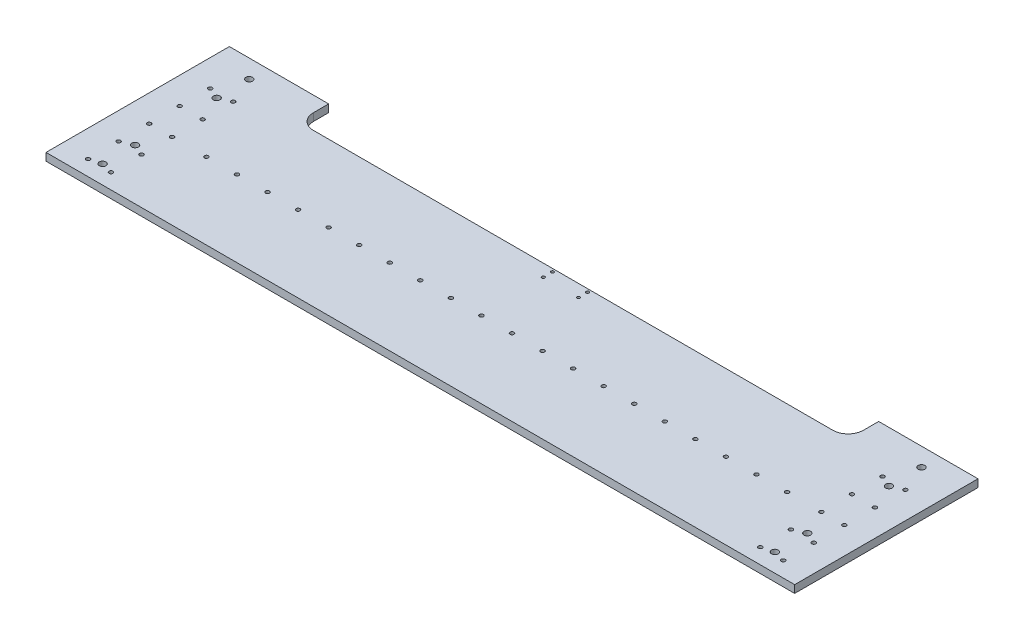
from build123d import *

# Parameters (mm, degrees)
SKETCH1_W                                        = 1244.6
SKETCH1_H                                        = 304.8
BOSS_EXTRUDE1_DEPTH                              = 12.7
CUT_EXTRUDE1_DEPTH                               = 641.815371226
CBORE_FOR_1_4_SOCKET_HEAD_CAP_SCREW1_D           = 6.5278
CBORE_FOR_1_4_SOCKET_HEAD_CAP_SCREW1_CBORE_D     = 11.1125
CBORE_FOR_1_4_SOCKET_HEAD_CAP_SCREW1_CBORE_DEPTH = 6.35
LPATTERN1_COUNT                                  = 2
LPATTERN1_PITCH                                  = 38.1
LPATTERN1_COUNT_DIR2                             = 5
LPATTERN1_PITCH_DIR2                             = 50.8
MIRROR1_COPY_1_D                                 = 6.5278
MIRROR1_COPY_1_CBORE_D                           = 11.1125
MIRROR1_COPY_1_CBORE_DEPTH                       = 6.35
MIRROR1_COPY_2_D                                 = 6.5278
MIRROR1_COPY_2_CBORE_D                           = 11.1125
MIRROR1_COPY_2_CBORE_DEPTH                       = 6.35
MIRROR1_COPY_3_D                                 = 6.5278
MIRROR1_COPY_3_CBORE_D                           = 11.1125
MIRROR1_COPY_3_CBORE_DEPTH                       = 6.35
MIRROR1_COPY_4_D                                 = 6.5278
MIRROR1_COPY_4_CBORE_D                           = 11.1125
MIRROR1_COPY_4_CBORE_DEPTH                       = 6.35
MIRROR1_COPY_5_D                                 = 6.5278
MIRROR1_COPY_5_CBORE_D                           = 11.1125
MIRROR1_COPY_5_CBORE_DEPTH                       = 6.35
MIRROR1_COPY_6_D                                 = 6.5278
MIRROR1_COPY_6_CBORE_D                           = 11.1125
MIRROR1_COPY_6_CBORE_DEPTH                       = 6.35
MIRROR1_COPY_7_D                                 = 6.5278
MIRROR1_COPY_7_CBORE_D                           = 11.1125
MIRROR1_COPY_7_CBORE_DEPTH                       = 6.35
MIRROR1_COPY_8_D                                 = 6.5278
MIRROR1_COPY_8_CBORE_D                           = 11.1125
MIRROR1_COPY_8_CBORE_DEPTH                       = 6.35
MIRROR1_COPY_9_D                                 = 6.5278
MIRROR1_COPY_9_CBORE_D                           = 11.1125
MIRROR1_COPY_9_CBORE_DEPTH                       = 6.35
CBORE_FOR_1_4_SOCKET_HEAD_CAP_SCREW2_D           = 6.5278
CBORE_FOR_1_4_SOCKET_HEAD_CAP_SCREW2_CBORE_D     = 11.1125
CBORE_FOR_1_4_SOCKET_HEAD_CAP_SCREW2_CBORE_DEPTH = 6.35
LPATTERN2_COUNT                                  = 20
LPATTERN2_PITCH                                  = 50.8
CBORE_FOR_10_SOCKET_HEAD_CAP_SCREW1_D            = 4.9784
CBORE_FOR_10_SOCKET_HEAD_CAP_SCREW1_CBORE_D      = 9.525
CBORE_FOR_10_SOCKET_HEAD_CAP_SCREW1_CBORE_DEPTH  = 4.826
F_7_16_0_4375_DIAMETER_HOLE1_D                   = 11.1125


with BuildPart() as part:
    # Sketch1 → Boss-Extrude1 (new body)
    with BuildSketch(Plane(origin=(0, 0, 0), x_dir=(1, 0, 0), z_dir=(0, 1, 0))):
        Rectangle(SKETCH1_W, SKETCH1_H)
    extrude(amount=BOSS_EXTRUDE1_DEPTH)

    # Sketch2 → Cut-Extrude1 (cut, through all)
    with BuildSketch(Plane(origin=(0, 12.7, 0), x_dir=(1, 0, 0), z_dir=(0, 1, 0))):
        with BuildLine():
            Line((-457.2, 152.4), (457.2, 152.4))
            Line((457.2, 152.4), (457.2, 127))
            ThreePointArc((457.2, 127), (449.760512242, 109.039487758), (431.8, 101.6))
            Line((431.8, 101.6), (-431.8, 101.6))
            ThreePointArc((-431.8, 101.6), (-449.760512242, 109.039487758), (-457.2, 127))
            Line((-457.2, 127), (-457.2, 152.4))
        make_face()
    extrude(amount=-CUT_EXTRUDE1_DEPTH, mode=Mode.SUBTRACT)

    # CBORE for 1_4 Socket Head Cap Screw1 (through all)
    with Locations(Plane(origin=(0, 0, 0), x_dir=(-1, 0, 0), z_dir=(0, -1, 0))):
        with Locations((577.85, 76.2)):
            cbore_for_1_4_socket_head_cap_screw1 = CounterBoreHole(CBORE_FOR_1_4_SOCKET_HEAD_CAP_SCREW1_D / 2, CBORE_FOR_1_4_SOCKET_HEAD_CAP_SCREW1_CBORE_D / 2, CBORE_FOR_1_4_SOCKET_HEAD_CAP_SCREW1_CBORE_DEPTH)

    # LPattern1: CBORE for 1_4 Socket Head Cap Screw1 2 × 5
    with Locations(*[(i * LPATTERN1_PITCH, 0, j * LPATTERN1_PITCH_DIR2) for i in range(LPATTERN1_COUNT) for j in range(LPATTERN1_COUNT_DIR2) if (i, j) != (0, 0)]):
        add(cbore_for_1_4_socket_head_cap_screw1, mode=Mode.SUBTRACT)

    # Mirror1: CBORE for 1_4 Socket Head Cap Screw1 across plane
    add(cbore_for_1_4_socket_head_cap_screw1.mirror(Plane(origin=(0, 0, 0), x_dir=(0, 0, 1), z_dir=(1, 0, 0))), mode=Mode.SUBTRACT)

    # Mirror1 copy 1 (through all)
    with Locations(Plane(origin=(0, 0, 50.8), x_dir=(1, 0, 0), z_dir=(0, -1, 0))):
        with Locations((577.85, -76.2)):
            CounterBoreHole(MIRROR1_COPY_1_D / 2, MIRROR1_COPY_1_CBORE_D / 2, MIRROR1_COPY_1_CBORE_DEPTH)

    # Mirror1 copy 2 (through all)
    with Locations(Plane(origin=(0, 0, 101.6), x_dir=(1, 0, 0), z_dir=(0, -1, 0))):
        with Locations((577.85, -76.2)):
            CounterBoreHole(MIRROR1_COPY_2_D / 2, MIRROR1_COPY_2_CBORE_D / 2, MIRROR1_COPY_2_CBORE_DEPTH)

    # Mirror1 copy 3 (through all)
    with Locations(Plane(origin=(0, 0, 152.4), x_dir=(1, 0, 0), z_dir=(0, -1, 0))):
        with Locations((577.85, -76.2)):
            CounterBoreHole(MIRROR1_COPY_3_D / 2, MIRROR1_COPY_3_CBORE_D / 2, MIRROR1_COPY_3_CBORE_DEPTH)

    # Mirror1 copy 4 (through all)
    with Locations(Plane(origin=(0, 0, 203.2), x_dir=(1, 0, 0), z_dir=(0, -1, 0))):
        with Locations((577.85, -76.2)):
            CounterBoreHole(MIRROR1_COPY_4_D / 2, MIRROR1_COPY_4_CBORE_D / 2, MIRROR1_COPY_4_CBORE_DEPTH)

    # Mirror1 copy 5 (through all)
    with Locations(Plane(origin=(-38.1, 0, 0), x_dir=(1, 0, 0), z_dir=(0, -1, 0))):
        with Locations((577.85, -76.2)):
            CounterBoreHole(MIRROR1_COPY_5_D / 2, MIRROR1_COPY_5_CBORE_D / 2, MIRROR1_COPY_5_CBORE_DEPTH)

    # Mirror1 copy 6 (through all)
    with Locations(Plane(origin=(-38.1, 0, 50.8), x_dir=(1, 0, 0), z_dir=(0, -1, 0))):
        with Locations((577.85, -76.2)):
            CounterBoreHole(MIRROR1_COPY_6_D / 2, MIRROR1_COPY_6_CBORE_D / 2, MIRROR1_COPY_6_CBORE_DEPTH)

    # Mirror1 copy 7 (through all)
    with Locations(Plane(origin=(-38.1, 0, 101.6), x_dir=(1, 0, 0), z_dir=(0, -1, 0))):
        with Locations((577.85, -76.2)):
            CounterBoreHole(MIRROR1_COPY_7_D / 2, MIRROR1_COPY_7_CBORE_D / 2, MIRROR1_COPY_7_CBORE_DEPTH)

    # Mirror1 copy 8 (through all)
    with Locations(Plane(origin=(-38.1, 0, 152.4), x_dir=(1, 0, 0), z_dir=(0, -1, 0))):
        with Locations((577.85, -76.2)):
            CounterBoreHole(MIRROR1_COPY_8_D / 2, MIRROR1_COPY_8_CBORE_D / 2, MIRROR1_COPY_8_CBORE_DEPTH)

    # Mirror1 copy 9 (through all)
    with Locations(Plane(origin=(-38.1, 0, 203.2), x_dir=(1, 0, 0), z_dir=(0, -1, 0))):
        with Locations((577.85, -76.2)):
            CounterBoreHole(MIRROR1_COPY_9_D / 2, MIRROR1_COPY_9_CBORE_D / 2, MIRROR1_COPY_9_CBORE_DEPTH)

    # CBORE for 1_4 Socket Head Cap Screw2 (through all)
    with Locations(Plane(origin=(0, 0, 0), x_dir=(-1, 0, 0), z_dir=(0, -1, 0))):
        with Locations((482.6, -25.4)):
            cbore_for_1_4_socket_head_cap_screw2 = CounterBoreHole(CBORE_FOR_1_4_SOCKET_HEAD_CAP_SCREW2_D / 2, CBORE_FOR_1_4_SOCKET_HEAD_CAP_SCREW2_CBORE_D / 2, CBORE_FOR_1_4_SOCKET_HEAD_CAP_SCREW2_CBORE_DEPTH)

    # LPattern2: CBORE for 1_4 Socket Head Cap Screw2 ×20
    with Locations(*[(i * LPATTERN2_PITCH, 0, 0) for i in range(1, LPATTERN2_COUNT)]):
        add(cbore_for_1_4_socket_head_cap_screw2, mode=Mode.SUBTRACT)

    # CBORE for _10 Socket Head Cap Screw1 (through all)
    with Locations(Plane(origin=(0, 0, 0), x_dir=(-1, 0, 0), z_dir=(0, -1, 0))):
        with Locations((29.21, 81.28), (-29.21, 81.28), (-29.21, 96.52), (29.21, 96.52)):
            CounterBoreHole(CBORE_FOR_10_SOCKET_HEAD_CAP_SCREW1_D / 2, CBORE_FOR_10_SOCKET_HEAD_CAP_SCREW1_CBORE_D / 2, CBORE_FOR_10_SOCKET_HEAD_CAP_SCREW1_CBORE_DEPTH)

    # 7_16 _0.4375_ Diameter Hole1 (through all)
    with Locations(Plane(origin=(0, 0, 0), x_dir=(-1, 0, 0), z_dir=(0, -1, 0))):
        with Locations((558.8, 121.8692), (558.8, 67.8942), (558.8, -67.83705), (558.8, -121.81205)):
            f_7_16_0_4375_diameter_hole1 = Hole(F_7_16_0_4375_DIAMETER_HOLE1_D / 2)

    # Mirror2: 7_16 _0.4375_ Diameter Hole1 across plane
    add(f_7_16_0_4375_diameter_hole1.mirror(Plane(origin=(0, 0, 0), x_dir=(0, 0, 1), z_dir=(1, 0, 0))), mode=Mode.SUBTRACT)


solid = part.part
